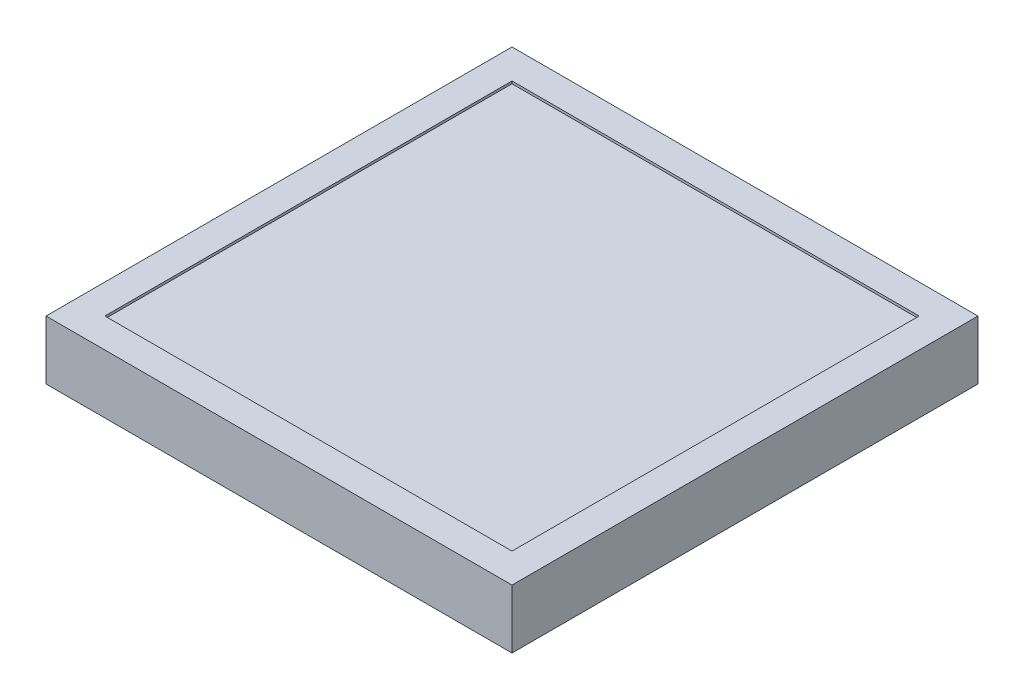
from build123d import *

# Parameters (mm, degrees)
CROQUIS1_W              = 190
CROQUIS1_H              = 190
SALIENTE_EXTRUIR1_DEPTH = 24
CROQUIS3_W              = 166
CROQUIS3_H              = 166
CORTAR_EXTRUIR2_DEPTH   = 1


with BuildPart() as part:
    # Croquis1 → Saliente-Extruir1 (new body)
    with BuildSketch(Plane(origin=(0, 0, 0), x_dir=(1, 0, 0), z_dir=(0, 1, 0))):
        with Locations((49.143471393, -50.254894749)):
            Rectangle(CROQUIS1_W, CROQUIS1_H)
    extrude(amount=SALIENTE_EXTRUIR1_DEPTH)

    # Croquis3 → Cortar-Extruir2 (cut)
    with BuildSketch(Plane(origin=(0, 24, 0), x_dir=(1, 0, 0), z_dir=(0, 1, 0))):
        with Locations((49.143471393, -50.254894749)):
            Rectangle(CROQUIS3_W, CROQUIS3_H)
    extrude(amount=-CORTAR_EXTRUIR2_DEPTH, mode=Mode.SUBTRACT)


solid = part.part
